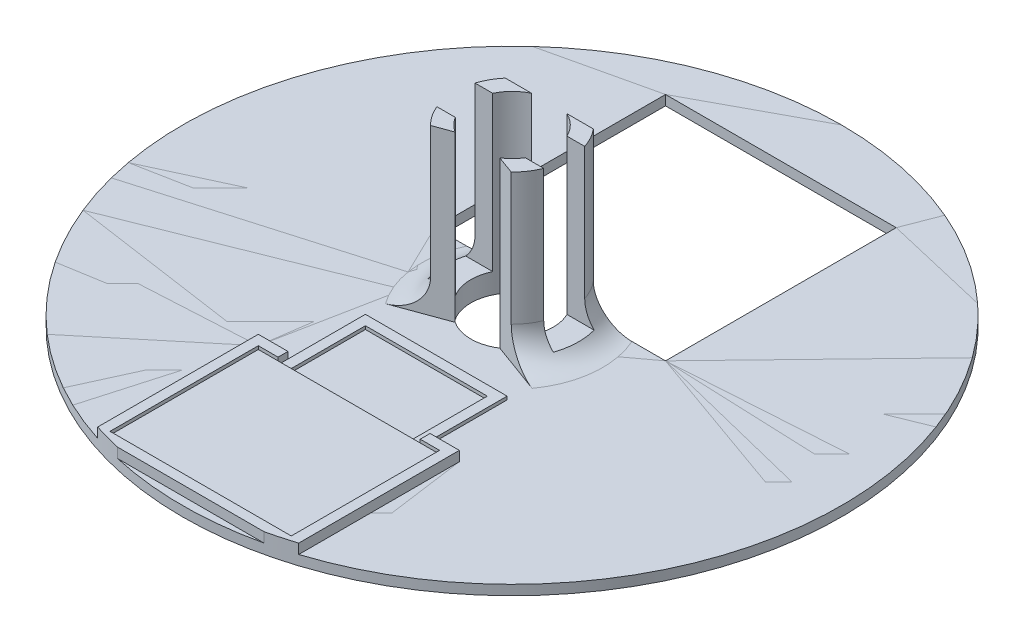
from build123d import *

# Parameters (mm, degrees)
SKETCH1_R               = 100
BOSS_EXTRUDE1_DEPTH     = 3
BOSS_EXTRUDE2_DEPTH     = 50
FILLET1_R               = 10
FILLET2_R               = 10
SKETCH3_W               = 37
SKETCH3_H               = 23
BOSS_EXTRUDE3_DEPTH     = 1
BOSS_EXTRUDE4_DEPTH     = 3
SKETCH5_W               = 55
SKETCH5_H               = 45
BOSS_EXTRUDE5_DEPTH     = 1
CUT_EXTRUDE2_DEPTH      = 152.026487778
CUT_EXTRUDE2_DEPTH_BACK = 152.026487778
SKETCH6_W               = 12
SKETCH6_H               = 93.723370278


with BuildPart() as part:
    # Sketch1 → Boss-Extrude1 (new body)
    with BuildSketch(Plane(origin=(0, 0, 0), x_dir=(1, 0, 0), z_dir=(0, 1, 0))):
        with Locations(Location((0, 0, 0), (0, 0, 270))):
            Circle(SKETCH1_R)
        with BuildLine():
            Line((5.344899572, 11.299648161), (35.265268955, 11.299648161))
            Line((35.265268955, 11.299648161), (35.265268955, 81.299648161))
            Line((35.265268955, 81.299648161), (-34.734731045, 81.299648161))
            Line((-34.734731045, 81.299648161), (-34.734731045, 11.299648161))
            Line((-34.734731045, 11.299648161), (-5.344899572, 11.299648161))
            ThreePointArc((-5.344899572, 11.299648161), (0, -12.5), (5.344899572, 11.299648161))
        make_face(mode=Mode.SUBTRACT)
    extrude(amount=BOSS_EXTRUDE1_DEPTH)

    # Sketch2 → Boss-Extrude2 (add)
    with BuildSketch(Plane(origin=(0, 3, 0), x_dir=(1, 0, 0), z_dir=(0, 1, 0))):
        with BuildLine():
            Line((-6.782329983, -10.5), (-12.247448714, -12.5))
            ThreePointArc((-12.247448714, -12.5), (-17.480809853, -0.819320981), (-13.362931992, 11.299648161))
            Line((-13.362931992, 11.299648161), (-5.344899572, 11.299648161))
            ThreePointArc((-5.344899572, 11.299648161), (-12.472914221, 0.822441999), (-6.782329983, -10.5))
        make_face()
        with BuildLine():
            Line((6.782329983, -10.5), (12.247448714, -12.5))
            ThreePointArc((12.247448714, -12.5), (17.480809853, -0.819320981), (13.362931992, 11.299648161))
            Line((13.362931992, 11.299648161), (5.344899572, 11.299648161))
            ThreePointArc((5.344899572, 11.299648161), (12.472914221, 0.822441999), (6.782329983, -10.5))
        make_face()
    extrude(amount=BOSS_EXTRUDE2_DEPTH)

    # Fillet1
    fillet1_edges = [part.edges().sort_by_distance(p)[0] for p in [
        (17.480809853, 3, 0.819320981),
    ]]
    fillet(fillet1_edges, radius=FILLET1_R)

    # Fillet2
    fillet2_edges = [part.edges().sort_by_distance(p)[0] for p in [
        (-17.480809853, 3, 0.819320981),
    ]]
    fillet(fillet2_edges, radius=FILLET2_R)

    # Sketch3 → Boss-Extrude3 (add)
    with BuildSketch(Plane(origin=(0, 3, 0), x_dir=(1, 0, 0), z_dir=(0, 1, 0))):
        Polygon((-21.5, -23.00037112), (-21.5, -49.5), (-27.5, -49.5), (-27.5, -94.5), (27.5, -94.5), (27.5, -49.5), (21.5, -49.5), (21.5, -23.00037112), align=None)
        with Locations((0, -37.50037112)):
            Rectangle(SKETCH3_W, SKETCH3_H, mode=Mode.SUBTRACT)
    extrude(amount=BOSS_EXTRUDE3_DEPTH)

    # Sketch4 → Boss-Extrude4 (add)
    with BuildSketch(Plane(origin=(0, 3, 0), x_dir=(1, 0, 0), z_dir=(0, 1, 0))):
        with BuildLine():
            Line((-27.5, -49.5), (-21.5, -49.5))
            Line((-21.5, -49.5), (-21.5, -46.5))
            Line((-21.5, -46.5), (-30.5, -46.5))
            Line((-30.5, -46.5), (-30.5, -95.235235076))
            ThreePointArc((-30.5, -95.235235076), (-26.384554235, -96.456494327), (-22.220486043, -97.5))
            Line((-22.220486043, -97.5), (22.220486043, -97.5))
            ThreePointArc((22.220486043, -97.5), (26.384554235, -96.456494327), (30.5, -95.235235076))
            Line((30.5, -95.235235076), (30.5, -46.5))
            Line((30.5, -46.5), (21.627841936, -46.5))
            Line((21.627841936, -46.5), (21.627841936, -49.5))
            Line((21.627841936, -49.5), (27.5, -49.5))
            Line((27.5, -49.5), (27.5, -94.5))
            Line((27.5, -94.5), (-27.5, -94.5))
            Line((-27.5, -94.5), (-27.5, -49.5))
        make_face()
    extrude(amount=BOSS_EXTRUDE4_DEPTH)

    # Sketch5 → Boss-Extrude5 (add)
    with BuildSketch(Plane(origin=(0, 4, 0), x_dir=(1, 0, 0), z_dir=(0, 1, 0))):
        with Locations((0, -72)):
            Rectangle(SKETCH5_W, SKETCH5_H)
    extrude(amount=BOSS_EXTRUDE5_DEPTH)

    # Sketch6 → Cut-Extrude2 (cut, two sides: drawn at the far end of the back side and taken through both)
    with BuildSketch(Plane(origin=(0, 0, 0), x_dir=(0, 0, -1), z_dir=(1, 0, 0)).offset(-CUT_EXTRUDE2_DEPTH_BACK)):
        with Locations((-0.600175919, 53)):
            Rectangle(SKETCH6_W, SKETCH6_H)
    extrude(amount=CUT_EXTRUDE2_DEPTH + CUT_EXTRUDE2_DEPTH_BACK, mode=Mode.SUBTRACT)


solid = part.part
